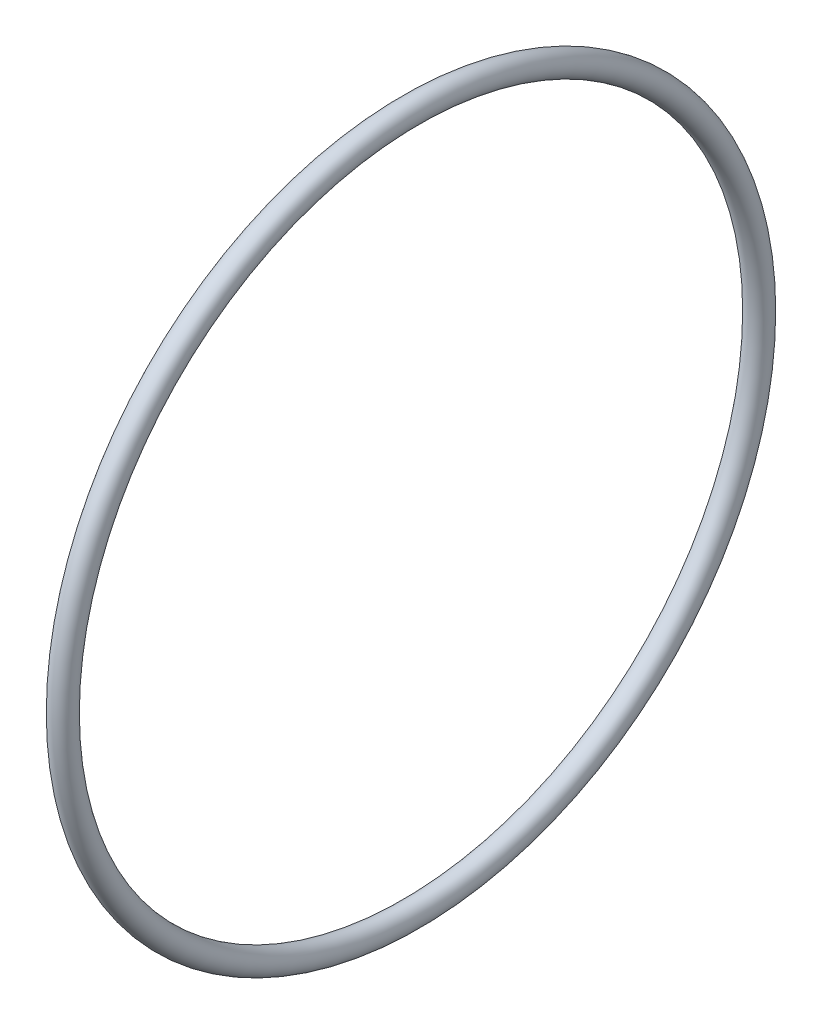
from build123d import *

# Parameters (mm, degrees)
SKETCH1_R = 1.7653


with BuildPart() as part:
    # Sketch1 → Revolve1 (revolve)
    with BuildSketch(Plane.XY, mode=Mode.PRIVATE) as revolve1_sk:
        with Locations((0, 52.5653)):
            Circle(SKETCH1_R)
    revolve(revolve1_sk.sketch.rotate(Axis((0, 0, 0), (-1, 0, 0)), 90), axis=Axis((0, 0, 0), (-1, 0, 0)))


solid = part.part
